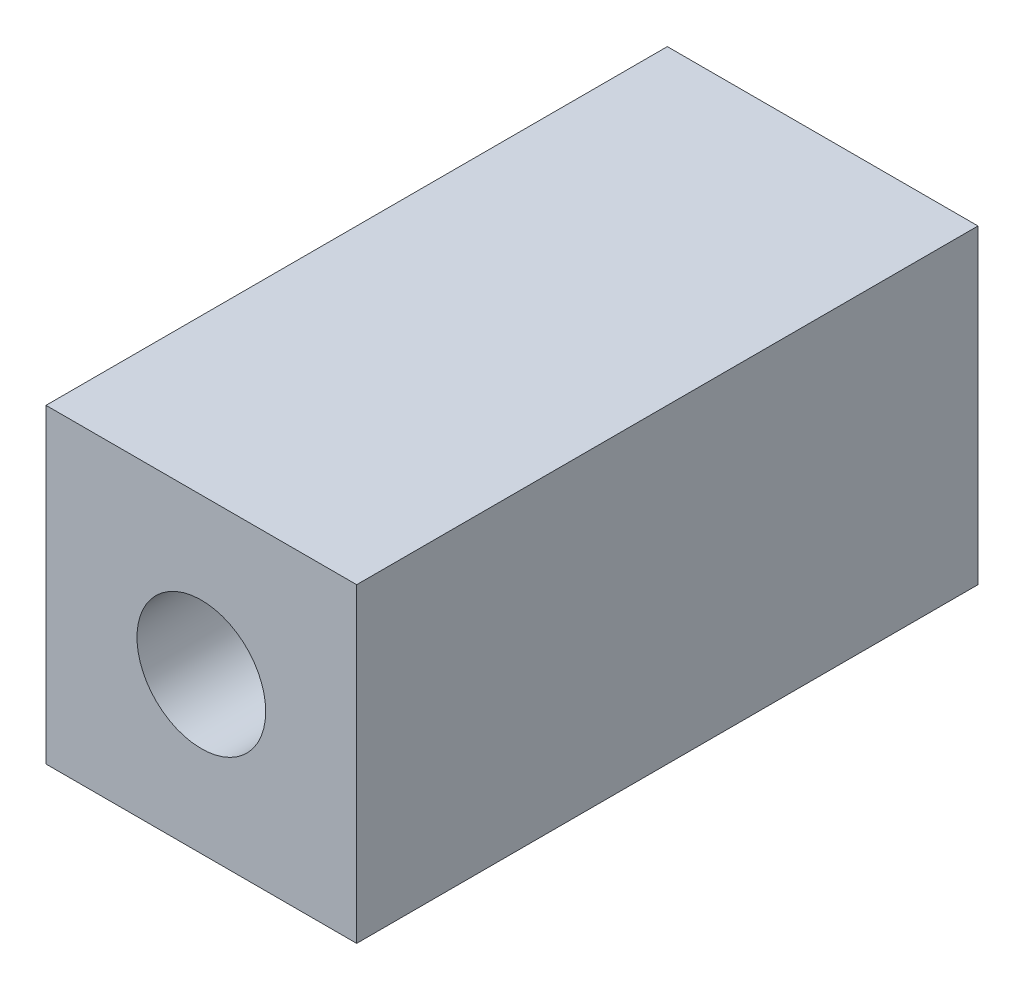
ISO-10303-21;
HEADER;
FILE_DESCRIPTION(('STEP AP214'),'2;1');
FILE_NAME('part.step','',(''),(''),'','','');
FILE_SCHEMA(('AUTOMOTIVE_DESIGN { 1 0 10303 214 1 1 1 1 }'));
ENDSEC;
DATA;
#1=APPLICATION_CONTEXT('core data for automotive mechanical design processes');
#2=APPLICATION_PROTOCOL_DEFINITION('international standard','automotive_design',2000,#1);
#3=PRODUCT_CONTEXT('',#1,'mechanical');
#4=PRODUCT('Part','Part','',(#3));
#5=PRODUCT_RELATED_PRODUCT_CATEGORY('part','',(#4));
#6=PRODUCT_DEFINITION_FORMATION('','',#4);
#7=PRODUCT_DEFINITION_CONTEXT('part definition',#1,'design');
#8=PRODUCT_DEFINITION('design','',#6,#7);
#9=PRODUCT_DEFINITION_SHAPE('','',#8);
#10=(LENGTH_UNIT() NAMED_UNIT(*) SI_UNIT(.MILLI.,.METRE.));
#11=(NAMED_UNIT(*) PLANE_ANGLE_UNIT() SI_UNIT($,.RADIAN.));
#12=(NAMED_UNIT(*) SI_UNIT($,.STERADIAN.) SOLID_ANGLE_UNIT());
#13=UNCERTAINTY_MEASURE_WITH_UNIT(LENGTH_MEASURE(1.E-05),#10,'distance_accuracy_value','');
#14=(GEOMETRIC_REPRESENTATION_CONTEXT(3) GLOBAL_UNCERTAINTY_ASSIGNED_CONTEXT((#13)) GLOBAL_UNIT_ASSIGNED_CONTEXT((#10,
#11,#12)) REPRESENTATION_CONTEXT('',''));
#15=CARTESIAN_POINT('',(0.,0.,0.));
#16=DIRECTION('',(0.,0.,1.));
#17=DIRECTION('',(1.,0.,0.));
#18=AXIS2_PLACEMENT_3D('',#15,#16,#17);
#19=CARTESIAN_POINT('',(0.,0.,70.));
#20=DIRECTION('',(1.,0.,0.));
#21=DIRECTION('',(0.,0.,-1.));
#22=AXIS2_PLACEMENT_3D('',#19,#20,#21);
#23=PLANE('',#22);
#24=DIRECTION('',(0.,-1.,0.));
#25=VECTOR('',#24,1.);
#26=CARTESIAN_POINT('',(0.,0.,0.));
#27=LINE('',#26,#25);
#28=CARTESIAN_POINT('',(0.,35.,0.));
#29=VERTEX_POINT('',#28);
#30=CARTESIAN_POINT('',(0.,0.,0.));
#31=VERTEX_POINT('',#30);
#32=EDGE_CURVE('E81',#29,#31,#27,.T.);
#33=ORIENTED_EDGE('',*,*,#32,.T.);
#34=DIRECTION('',(0.,0.,-1.));
#35=VECTOR('',#34,1.);
#36=CARTESIAN_POINT('',(0.,0.,70.));
#37=LINE('',#36,#35);
#38=CARTESIAN_POINT('',(0.,0.,70.));
#39=VERTEX_POINT('',#38);
#40=EDGE_CURVE('E11',#39,#31,#37,.T.);
#41=ORIENTED_EDGE('',*,*,#40,.F.);
#42=DIRECTION('',(0.,-1.,0.));
#43=VECTOR('',#42,1.);
#44=CARTESIAN_POINT('',(0.,0.,70.));
#45=LINE('',#44,#43);
#46=CARTESIAN_POINT('',(0.,35.,70.));
#47=VERTEX_POINT('',#46);
#48=EDGE_CURVE('E92',#47,#39,#45,.T.);
#49=ORIENTED_EDGE('',*,*,#48,.F.);
#50=DIRECTION('',(0.,0.,-1.));
#51=VECTOR('',#50,1.);
#52=CARTESIAN_POINT('',(0.,35.,70.));
#53=LINE('',#52,#51);
#54=EDGE_CURVE('E98',#47,#29,#53,.T.);
#55=ORIENTED_EDGE('',*,*,#54,.T.);
#56=EDGE_LOOP('',(#33,#41,#49,#55));
#57=FACE_BOUND('',#56,.T.);
#58=ADVANCED_FACE('F28',(#57),#23,.F.);
#59=CARTESIAN_POINT('',(0.,0.,70.));
#60=DIRECTION('',(0.,1.,0.));
#61=DIRECTION('',(0.,0.,1.));
#62=AXIS2_PLACEMENT_3D('',#59,#60,#61);
#63=PLANE('',#62);
#64=DIRECTION('',(1.,0.,0.));
#65=VECTOR('',#64,1.);
#66=CARTESIAN_POINT('',(0.,0.,0.));
#67=LINE('',#66,#65);
#68=CARTESIAN_POINT('',(35.,0.,0.));
#69=VERTEX_POINT('',#68);
#70=EDGE_CURVE('E86',#31,#69,#67,.T.);
#71=ORIENTED_EDGE('',*,*,#70,.T.);
#72=DIRECTION('',(0.,0.,-1.));
#73=VECTOR('',#72,1.);
#74=CARTESIAN_POINT('',(35.,0.,70.));
#75=LINE('',#74,#73);
#76=CARTESIAN_POINT('',(35.,0.,70.));
#77=VERTEX_POINT('',#76);
#78=EDGE_CURVE('E35',#77,#69,#75,.T.);
#79=ORIENTED_EDGE('',*,*,#78,.F.);
#80=DIRECTION('',(1.,0.,0.));
#81=VECTOR('',#80,1.);
#82=CARTESIAN_POINT('',(0.,0.,70.));
#83=LINE('',#82,#81);
#84=EDGE_CURVE('E94',#39,#77,#83,.T.);
#85=ORIENTED_EDGE('',*,*,#84,.F.);
#86=ORIENTED_EDGE('',*,*,#40,.T.);
#87=EDGE_LOOP('',(#71,#79,#85,#86));
#88=FACE_BOUND('',#87,.T.);
#89=ADVANCED_FACE('F119',(#88),#63,.F.);
#90=CARTESIAN_POINT('',(35.,0.,70.));
#91=DIRECTION('',(-1.,0.,0.));
#92=DIRECTION('',(0.,0.,1.));
#93=AXIS2_PLACEMENT_3D('',#90,#91,#92);
#94=PLANE('',#93);
#95=DIRECTION('',(0.,1.,0.));
#96=VECTOR('',#95,1.);
#97=CARTESIAN_POINT('',(35.,0.,0.));
#98=LINE('',#97,#96);
#99=CARTESIAN_POINT('',(35.,35.,0.));
#100=VERTEX_POINT('',#99);
#101=EDGE_CURVE('E88',#69,#100,#98,.T.);
#102=ORIENTED_EDGE('',*,*,#101,.T.);
#103=DIRECTION('',(0.,0.,-1.));
#104=VECTOR('',#103,1.);
#105=CARTESIAN_POINT('',(35.,35.,70.));
#106=LINE('',#105,#104);
#107=CARTESIAN_POINT('',(35.,35.,70.));
#108=VERTEX_POINT('',#107);
#109=EDGE_CURVE('E101',#108,#100,#106,.T.);
#110=ORIENTED_EDGE('',*,*,#109,.F.);
#111=DIRECTION('',(0.,1.,0.));
#112=VECTOR('',#111,1.);
#113=CARTESIAN_POINT('',(35.,0.,70.));
#114=LINE('',#113,#112);
#115=EDGE_CURVE('E47',#77,#108,#114,.T.);
#116=ORIENTED_EDGE('',*,*,#115,.F.);
#117=ORIENTED_EDGE('',*,*,#78,.T.);
#118=EDGE_LOOP('',(#102,#110,#116,#117));
#119=FACE_BOUND('',#118,.T.);
#120=ADVANCED_FACE('F107',(#119),#94,.F.);
#121=CARTESIAN_POINT('',(0.,35.,70.));
#122=DIRECTION('',(0.,-1.,0.));
#123=DIRECTION('',(0.,0.,-1.));
#124=AXIS2_PLACEMENT_3D('',#121,#122,#123);
#125=PLANE('',#124);
#126=DIRECTION('',(-1.,0.,0.));
#127=VECTOR('',#126,1.);
#128=CARTESIAN_POINT('',(0.,35.,0.));
#129=LINE('',#128,#127);
#130=EDGE_CURVE('E90',#100,#29,#129,.T.);
#131=ORIENTED_EDGE('',*,*,#130,.T.);
#132=ORIENTED_EDGE('',*,*,#54,.F.);
#133=DIRECTION('',(-1.,0.,0.));
#134=VECTOR('',#133,1.);
#135=CARTESIAN_POINT('',(0.,35.,70.));
#136=LINE('',#135,#134);
#137=EDGE_CURVE('E42',#108,#47,#136,.T.);
#138=ORIENTED_EDGE('',*,*,#137,.F.);
#139=ORIENTED_EDGE('',*,*,#109,.T.);
#140=EDGE_LOOP('',(#131,#132,#138,#139));
#141=FACE_BOUND('',#140,.T.);
#142=ADVANCED_FACE('F114',(#141),#125,.F.);
#143=CARTESIAN_POINT('',(0.,35.,70.));
#144=DIRECTION('',(0.,0.,-1.));
#145=DIRECTION('',(-1.,0.,0.));
#146=AXIS2_PLACEMENT_3D('',#143,#144,#145);
#147=PLANE('',#146);
#148=CARTESIAN_POINT('',(17.5,17.5,70.));
#149=DIRECTION('',(0.,0.,1.));
#150=DIRECTION('',(1.,0.,0.));
#151=AXIS2_PLACEMENT_3D('',#148,#149,#150);
#152=CIRCLE('',#151,7.25);
#153=CARTESIAN_POINT('',(24.75,17.5,70.));
#154=VERTEX_POINT('',#153);
#155=EDGE_CURVE('E78',#154,#154,#152,.T.);
#156=ORIENTED_EDGE('',*,*,#155,.F.);
#157=EDGE_LOOP('',(#156));
#158=FACE_BOUND('',#157,.T.);
#159=ORIENTED_EDGE('',*,*,#48,.T.);
#160=ORIENTED_EDGE('',*,*,#84,.T.);
#161=ORIENTED_EDGE('',*,*,#115,.T.);
#162=ORIENTED_EDGE('',*,*,#137,.T.);
#163=EDGE_LOOP('',(#159,#160,#161,#162));
#164=FACE_BOUND('',#163,.T.);
#165=ADVANCED_FACE('F118',(#158,#164),#147,.F.);
#166=CARTESIAN_POINT('',(0.,35.,0.));
#167=DIRECTION('',(0.,0.,-1.));
#168=DIRECTION('',(-1.,0.,0.));
#169=AXIS2_PLACEMENT_3D('',#166,#167,#168);
#170=PLANE('',#169);
#171=ORIENTED_EDGE('',*,*,#32,.F.);
#172=ORIENTED_EDGE('',*,*,#130,.F.);
#173=ORIENTED_EDGE('',*,*,#101,.F.);
#174=ORIENTED_EDGE('',*,*,#70,.F.);
#175=EDGE_LOOP('',(#171,#172,#173,#174));
#176=FACE_BOUND('',#175,.T.);
#177=ADVANCED_FACE('F112',(#176),#170,.T.);
#178=CARTESIAN_POINT('',(17.5,17.5,70.));
#179=DIRECTION('',(0.,0.,1.));
#180=DIRECTION('',(1.,0.,0.));
#181=AXIS2_PLACEMENT_3D('',#178,#179,#180);
#182=CYLINDRICAL_SURFACE('',#181,7.24999999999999);
#183=CARTESIAN_POINT('',(17.5,17.5,18.5));
#184=DIRECTION('',(0.,0.,1.));
#185=DIRECTION('',(1.,0.,0.));
#186=AXIS2_PLACEMENT_3D('',#183,#184,#185);
#187=CIRCLE('',#186,7.24999999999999);
#188=CARTESIAN_POINT('',(24.75,17.5,18.5));
#189=VERTEX_POINT('',#188);
#190=EDGE_CURVE('E76',#189,#189,#187,.T.);
#191=ORIENTED_EDGE('',*,*,#190,.F.);
#192=EDGE_LOOP('',(#191));
#193=FACE_BOUND('',#192,.T.);
#194=ORIENTED_EDGE('',*,*,#155,.T.);
#195=EDGE_LOOP('',(#194));
#196=FACE_BOUND('',#195,.T.);
#197=ADVANCED_FACE('F72',(#193,#196),#182,.F.);
#198=CARTESIAN_POINT('',(17.5,17.5,18.5));
#199=DIRECTION('',(0.,0.,1.));
#200=DIRECTION('',(1.,0.,0.));
#201=AXIS2_PLACEMENT_3D('',#198,#199,#200);
#202=CONICAL_SURFACE('',#201,7.24999999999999,1.02974425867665);
#203=CARTESIAN_POINT('',(17.5,17.5,14.1437605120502));
#204=VERTEX_POINT('',#203);
#205=VERTEX_LOOP('',#204);
#206=FACE_BOUND('',#205,.T.);
#207=ORIENTED_EDGE('',*,*,#190,.T.);
#208=EDGE_LOOP('',(#207));
#209=FACE_BOUND('',#208,.T.);
#210=ADVANCED_FACE('F69',(#206,#209),#202,.F.);
#211=CLOSED_SHELL('',(#58,#89,#120,#142,#165,#177,#197,#210));
#212=MANIFOLD_SOLID_BREP('B2',#211);
#213=ADVANCED_BREP_SHAPE_REPRESENTATION('',(#18,#212),#14);
#214=SHAPE_DEFINITION_REPRESENTATION(#9,#213);
ENDSEC;
END-ISO-10303-21;
